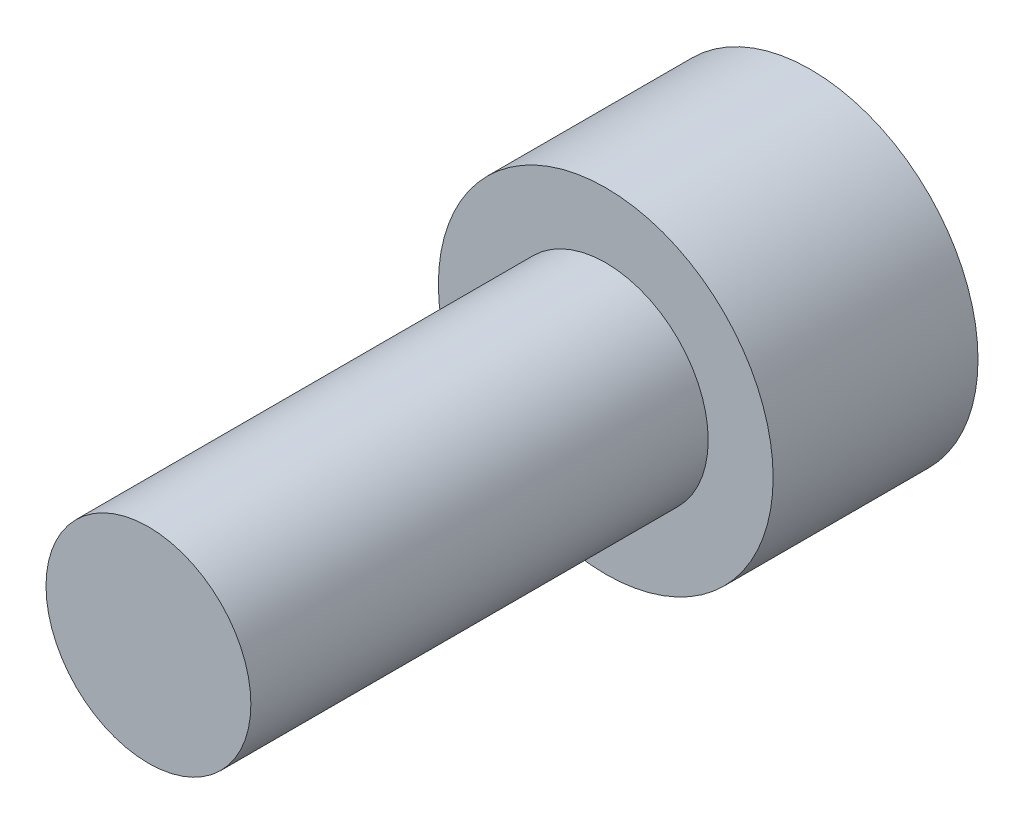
from build123d import *

# Parameters (mm, degrees)
HEX_2_DEPTH = 1.778


with BuildPart() as part:
    # Sketch6 → Revolve1 (revolve)
    with BuildSketch(Plane(origin=(0, 0, 0), x_dir=(0, 0, -1), z_dir=(1, 0, 0)), mode=Mode.PRIVATE) as revolve1_sk:
        Polygon((-6.35, 0), (-6.35, -1.4224), (0, -1.4224), (0, -2.3241), (2.8448, -2.3241), (2.8448, 0), align=None)
    revolve(revolve1_sk.sketch.rotate(Axis((0, 0, 6.35), (0, 0, -1)), 270), axis=Axis((0, 0, 6.35), (0, 0, -1)))

    # Sketch7 → HEX 2 (cut)
    with BuildSketch(Plane(origin=(0, 0, -2.8448), x_dir=(-1, 0, 0), z_dir=(0, 0, -1))):
        Polygon((-1.1811, 0.681908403), (-1.1811, -0.681908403), (0, -1.363816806), (1.1811, -0.681908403), (1.1811, 0.681908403), (0, 1.363816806), align=None)
    extrude(amount=-HEX_2_DEPTH, mode=Mode.SUBTRACT)


solid = part.part
